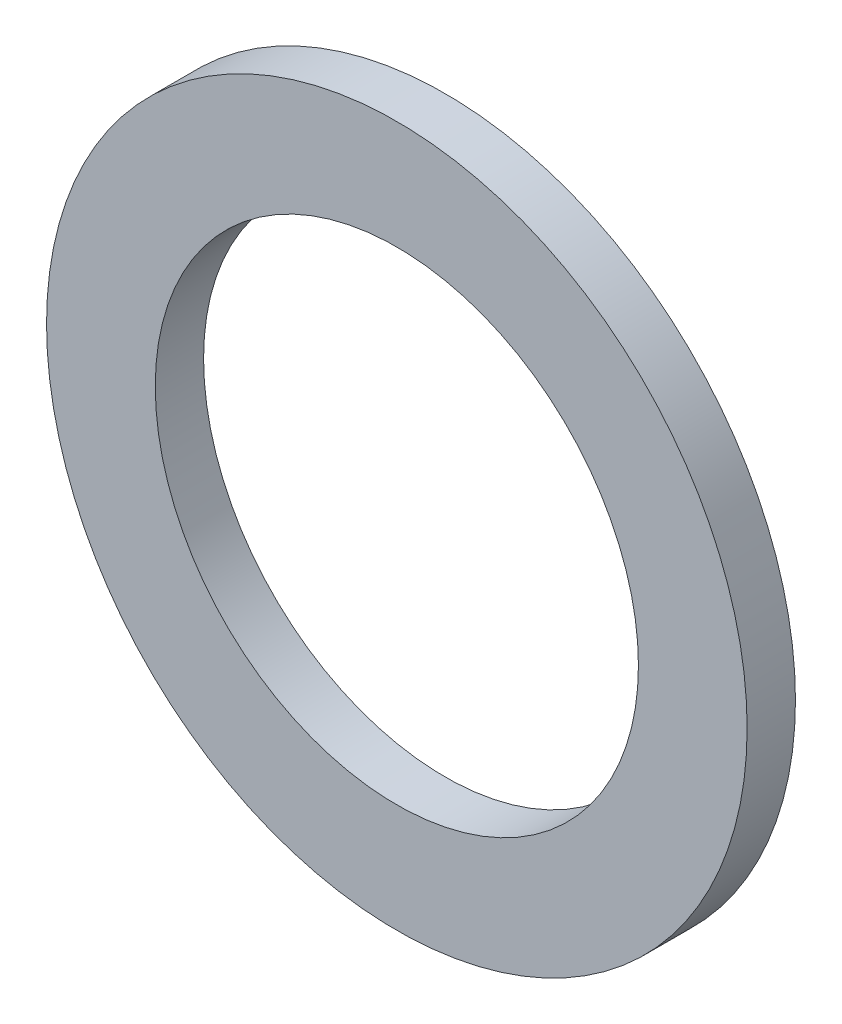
ISO-10303-21;
HEADER;
FILE_DESCRIPTION(('STEP AP214'),'2;1');
FILE_NAME('part.step','',(''),(''),'','','');
FILE_SCHEMA(('AUTOMOTIVE_DESIGN { 1 0 10303 214 1 1 1 1 }'));
ENDSEC;
DATA;
#1=APPLICATION_CONTEXT('core data for automotive mechanical design processes');
#2=APPLICATION_PROTOCOL_DEFINITION('international standard','automotive_design',2000,#1);
#3=PRODUCT_CONTEXT('',#1,'mechanical');
#4=PRODUCT('Part','Part','',(#3));
#5=PRODUCT_RELATED_PRODUCT_CATEGORY('part','',(#4));
#6=PRODUCT_DEFINITION_FORMATION('','',#4);
#7=PRODUCT_DEFINITION_CONTEXT('part definition',#1,'design');
#8=PRODUCT_DEFINITION('design','',#6,#7);
#9=PRODUCT_DEFINITION_SHAPE('','',#8);
#10=(LENGTH_UNIT() NAMED_UNIT(*) SI_UNIT(.MILLI.,.METRE.));
#11=(NAMED_UNIT(*) PLANE_ANGLE_UNIT() SI_UNIT($,.RADIAN.));
#12=(NAMED_UNIT(*) SI_UNIT($,.STERADIAN.) SOLID_ANGLE_UNIT());
#13=UNCERTAINTY_MEASURE_WITH_UNIT(LENGTH_MEASURE(1.E-05),#10,'distance_accuracy_value','');
#14=(GEOMETRIC_REPRESENTATION_CONTEXT(3) GLOBAL_UNCERTAINTY_ASSIGNED_CONTEXT((#13)) GLOBAL_UNIT_ASSIGNED_CONTEXT((#10,
#11,#12)) REPRESENTATION_CONTEXT('',''));
#15=CARTESIAN_POINT('',(0.,0.,0.));
#16=DIRECTION('',(0.,0.,1.));
#17=DIRECTION('',(1.,0.,0.));
#18=AXIS2_PLACEMENT_3D('',#15,#16,#17);
#19=CARTESIAN_POINT('',(4.5,0.,-43.0121933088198));
#20=DIRECTION('',(0.,0.,1.));
#21=DIRECTION('',(1.,0.,0.));
#22=AXIS2_PLACEMENT_3D('',#19,#20,#21);
#23=CYLINDRICAL_SURFACE('',#22,14.5);
#24=CARTESIAN_POINT('',(4.5,0.,0.));
#25=DIRECTION('',(0.,0.,1.));
#26=DIRECTION('',(1.,0.,0.));
#27=AXIS2_PLACEMENT_3D('',#24,#25,#26);
#28=CIRCLE('',#27,14.5);
#29=CARTESIAN_POINT('',(19.,0.,0.));
#30=VERTEX_POINT('',#29);
#31=EDGE_CURVE('E36',#30,#30,#28,.T.);
#32=ORIENTED_EDGE('',*,*,#31,.F.);
#33=EDGE_LOOP('',(#32));
#34=FACE_BOUND('',#33,.T.);
#35=CARTESIAN_POINT('',(4.5,0.,-2.00000000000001));
#36=DIRECTION('',(0.,0.,-1.));
#37=DIRECTION('',(-1.,0.,0.));
#38=AXIS2_PLACEMENT_3D('',#35,#36,#37);
#39=CIRCLE('',#38,14.5);
#40=CARTESIAN_POINT('',(-9.99999999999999,0.,-2.00000000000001));
#41=VERTEX_POINT('',#40);
#42=EDGE_CURVE('E45',#41,#41,#39,.F.);
#43=ORIENTED_EDGE('',*,*,#42,.T.);
#44=EDGE_LOOP('',(#43));
#45=FACE_BOUND('',#44,.T.);
#46=ADVANCED_FACE('F29',(#34,#45),#23,.T.);
#47=CARTESIAN_POINT('',(4.5,0.,-43.0121933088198));
#48=DIRECTION('',(0.,0.,1.));
#49=DIRECTION('',(1.,0.,0.));
#50=AXIS2_PLACEMENT_3D('',#47,#48,#49);
#51=CYLINDRICAL_SURFACE('',#50,10.);
#52=CARTESIAN_POINT('',(4.5,0.,0.));
#53=DIRECTION('',(0.,0.,1.));
#54=DIRECTION('',(1.,0.,0.));
#55=AXIS2_PLACEMENT_3D('',#52,#53,#54);
#56=CIRCLE('',#55,10.);
#57=CARTESIAN_POINT('',(14.5,0.,0.));
#58=VERTEX_POINT('',#57);
#59=EDGE_CURVE('E40',#58,#58,#56,.T.);
#60=ORIENTED_EDGE('',*,*,#59,.T.);
#61=EDGE_LOOP('',(#60));
#62=FACE_BOUND('',#61,.T.);
#63=CARTESIAN_POINT('',(4.5,0.,-2.00000000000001));
#64=DIRECTION('',(0.,0.,-1.));
#65=DIRECTION('',(-1.,0.,0.));
#66=AXIS2_PLACEMENT_3D('',#63,#64,#65);
#67=CIRCLE('',#66,10.);
#68=CARTESIAN_POINT('',(-5.5,0.,-2.00000000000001));
#69=VERTEX_POINT('',#68);
#70=EDGE_CURVE('E10',#69,#69,#67,.F.);
#71=ORIENTED_EDGE('',*,*,#70,.F.);
#72=EDGE_LOOP('',(#71));
#73=FACE_BOUND('',#72,.T.);
#74=ADVANCED_FACE('F56',(#62,#73),#51,.F.);
#75=CARTESIAN_POINT('',(4.5,0.,0.));
#76=DIRECTION('',(0.,0.,1.));
#77=DIRECTION('',(1.,0.,0.));
#78=AXIS2_PLACEMENT_3D('',#75,#76,#77);
#79=PLANE('',#78);
#80=ORIENTED_EDGE('',*,*,#59,.F.);
#81=EDGE_LOOP('',(#80));
#82=FACE_BOUND('',#81,.T.);
#83=ORIENTED_EDGE('',*,*,#31,.T.);
#84=EDGE_LOOP('',(#83));
#85=FACE_BOUND('',#84,.T.);
#86=ADVANCED_FACE('F52',(#82,#85),#79,.T.);
#87=CARTESIAN_POINT('',(15.,0.,-2.00000000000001));
#88=DIRECTION('',(0.,0.,-1.));
#89=DIRECTION('',(-1.,0.,0.));
#90=AXIS2_PLACEMENT_3D('',#87,#88,#89);
#91=PLANE('',#90);
#92=ORIENTED_EDGE('',*,*,#42,.F.);
#93=EDGE_LOOP('',(#92));
#94=FACE_BOUND('',#93,.T.);
#95=ORIENTED_EDGE('',*,*,#70,.T.);
#96=EDGE_LOOP('',(#95));
#97=FACE_BOUND('',#96,.T.);
#98=ADVANCED_FACE('F31',(#94,#97),#91,.T.);
#99=CLOSED_SHELL('',(#46,#74,#86,#98));
#100=MANIFOLD_SOLID_BREP('B2',#99);
#101=ADVANCED_BREP_SHAPE_REPRESENTATION('',(#18,#100),#14);
#102=SHAPE_DEFINITION_REPRESENTATION(#9,#101);
ENDSEC;
END-ISO-10303-21;
